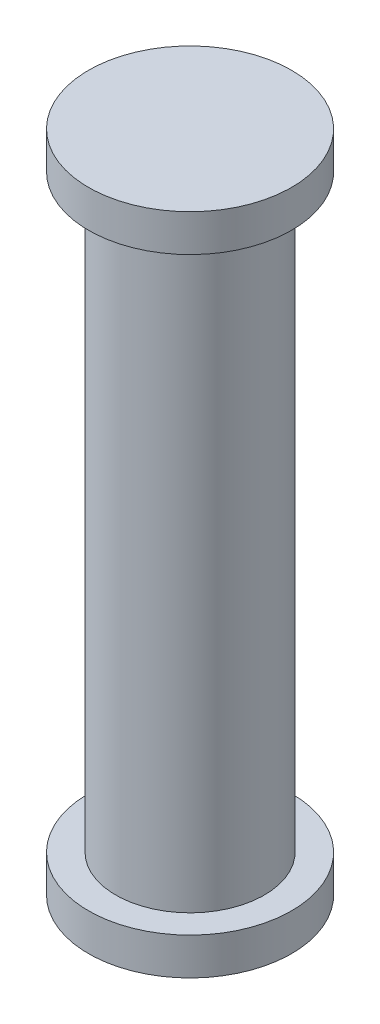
from build123d import *


with BuildPart() as part:
    # Sketch1 → Revolve1 (revolve)
    with BuildSketch(Plane(origin=(0, 0, 0), x_dir=(0, 0, -1), z_dir=(1, 0, 0))):
        Polygon((0, 0), (4.1, 0), (4.1, -1.5), (3, -1.5), (3, -25.3), (4.1, -25.3), (4.1, -26.8), (0, -26.8), align=None)
    revolve(axis=Axis((0, -26.8, 0), (0, 1, 0)))


solid = part.part
